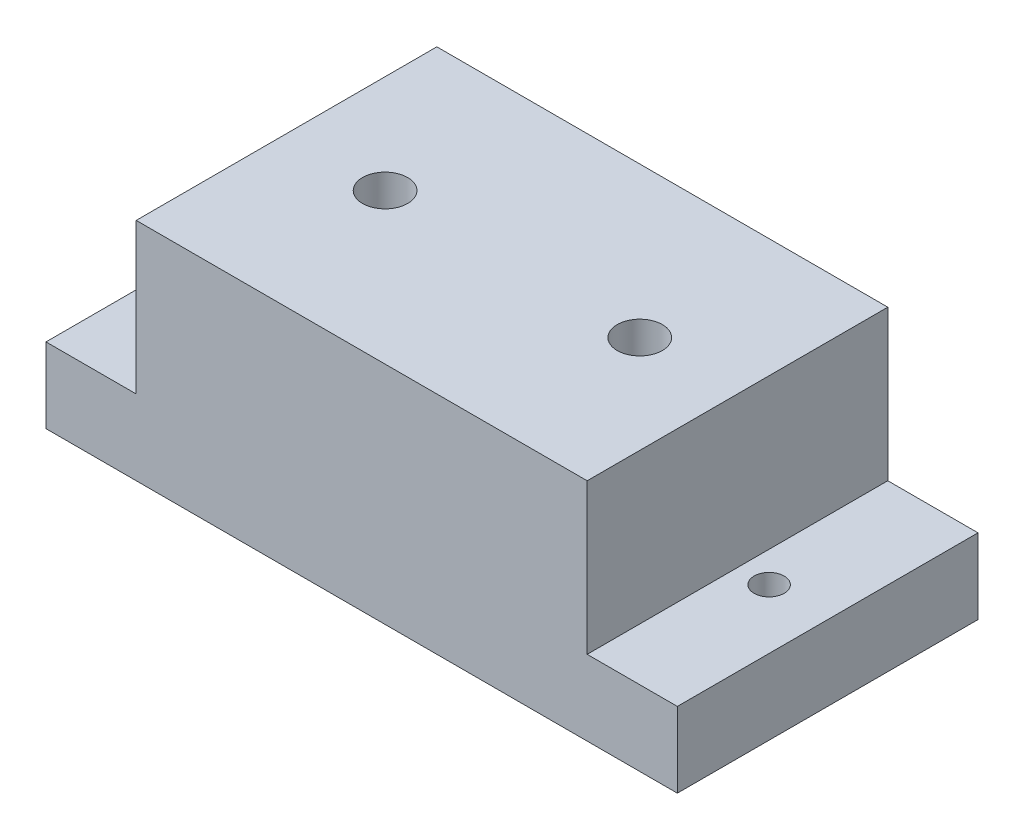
ISO-10303-21;
HEADER;
FILE_DESCRIPTION(('STEP AP214'),'2;1');
FILE_NAME('part.step','',(''),(''),'','','');
FILE_SCHEMA(('AUTOMOTIVE_DESIGN { 1 0 10303 214 1 1 1 1 }'));
ENDSEC;
DATA;
#1=APPLICATION_CONTEXT('core data for automotive mechanical design processes');
#2=APPLICATION_PROTOCOL_DEFINITION('international standard','automotive_design',2000,#1);
#3=PRODUCT_CONTEXT('',#1,'mechanical');
#4=PRODUCT('Part','Part','',(#3));
#5=PRODUCT_RELATED_PRODUCT_CATEGORY('part','',(#4));
#6=PRODUCT_DEFINITION_FORMATION('','',#4);
#7=PRODUCT_DEFINITION_CONTEXT('part definition',#1,'design');
#8=PRODUCT_DEFINITION('design','',#6,#7);
#9=PRODUCT_DEFINITION_SHAPE('','',#8);
#10=(LENGTH_UNIT() NAMED_UNIT(*) SI_UNIT(.MILLI.,.METRE.));
#11=(NAMED_UNIT(*) PLANE_ANGLE_UNIT() SI_UNIT($,.RADIAN.));
#12=(NAMED_UNIT(*) SI_UNIT($,.STERADIAN.) SOLID_ANGLE_UNIT());
#13=UNCERTAINTY_MEASURE_WITH_UNIT(LENGTH_MEASURE(1.E-05),#10,'distance_accuracy_value','');
#14=(GEOMETRIC_REPRESENTATION_CONTEXT(3) GLOBAL_UNCERTAINTY_ASSIGNED_CONTEXT((#13)) GLOBAL_UNIT_ASSIGNED_CONTEXT((#10,
#11,#12)) REPRESENTATION_CONTEXT('',''));
#15=CARTESIAN_POINT('',(0.,0.,0.));
#16=DIRECTION('',(0.,0.,1.));
#17=DIRECTION('',(1.,0.,0.));
#18=AXIS2_PLACEMENT_3D('',#15,#16,#17);
#19=CARTESIAN_POINT('',(-42.,0.,40.));
#20=DIRECTION('',(0.,1.,0.));
#21=DIRECTION('',(-1.,0.,0.));
#22=AXIS2_PLACEMENT_3D('',#19,#20,#21);
#23=PLANE('',#22);
#24=DIRECTION('',(-0.875367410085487,0.,-0.483458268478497));
#25=VECTOR('',#24,1.);
#26=CARTESIAN_POINT('',(-11.860847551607,0.,16.9012731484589));
#27=LINE('',#26,#25);
#28=CARTESIAN_POINT('',(-11.860847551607,0.,16.9012731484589));
#29=VERTEX_POINT('',#28);
#30=CARTESIAN_POINT('',(-17.1139999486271,0.,14.));
#31=VERTEX_POINT('',#30);
#32=EDGE_CURVE('E369',#29,#31,#27,.T.);
#33=ORIENTED_EDGE('',*,*,#32,.T.);
#34=DIRECTION('',(-0.856370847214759,0.,0.516361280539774));
#35=VECTOR('',#34,1.);
#36=CARTESIAN_POINT('',(-17.1139999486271,0.,14.));
#37=LINE('',#36,#35);
#38=CARTESIAN_POINT('',(-22.2531523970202,0.,17.0987268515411));
#39=VERTEX_POINT('',#38);
#40=EDGE_CURVE('E530',#31,#39,#37,.T.);
#41=ORIENTED_EDGE('',*,*,#40,.T.);
#42=DIRECTION('',(0.0189965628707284,0.,0.999819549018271));
#43=VECTOR('',#42,1.);
#44=CARTESIAN_POINT('',(-22.2531523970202,0.,17.0987268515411));
#45=LINE('',#44,#43);
#46=CARTESIAN_POINT('',(-22.1391524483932,0.,23.0987268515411));
#47=VERTEX_POINT('',#46);
#48=EDGE_CURVE('E527',#39,#47,#45,.T.);
#49=ORIENTED_EDGE('',*,*,#48,.T.);
#50=DIRECTION('',(0.875367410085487,0.,0.483458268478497));
#51=VECTOR('',#50,1.);
#52=CARTESIAN_POINT('',(-22.1391524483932,0.,23.0987268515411));
#53=LINE('',#52,#51);
#54=CARTESIAN_POINT('',(-16.8860000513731,0.,26.));
#55=VERTEX_POINT('',#54);
#56=EDGE_CURVE('E524',#47,#55,#53,.T.);
#57=ORIENTED_EDGE('',*,*,#56,.T.);
#58=DIRECTION('',(0.856370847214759,0.,-0.516361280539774));
#59=VECTOR('',#58,1.);
#60=CARTESIAN_POINT('',(-16.8860000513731,0.,26.));
#61=LINE('',#60,#59);
#62=CARTESIAN_POINT('',(-11.74684760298,0.,22.9012731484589));
#63=VERTEX_POINT('',#62);
#64=EDGE_CURVE('E516',#55,#63,#61,.T.);
#65=ORIENTED_EDGE('',*,*,#64,.T.);
#66=DIRECTION('',(-0.0189965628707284,0.,-0.999819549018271));
#67=VECTOR('',#66,1.);
#68=CARTESIAN_POINT('',(-11.74684760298,0.,22.9012731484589));
#69=LINE('',#68,#67);
#70=EDGE_CURVE('E514',#63,#29,#69,.T.);
#71=ORIENTED_EDGE('',*,*,#70,.T.);
#72=EDGE_LOOP('',(#33,#41,#49,#57,#65,#71));
#73=FACE_BOUND('',#72,.T.);
#74=DIRECTION('',(1.,0.,0.));
#75=VECTOR('',#74,1.);
#76=CARTESIAN_POINT('',(-42.,0.,0.));
#77=LINE('',#76,#75);
#78=CARTESIAN_POINT('',(-42.,0.,0.));
#79=VERTEX_POINT('',#78);
#80=CARTESIAN_POINT('',(42.,0.,0.));
#81=VERTEX_POINT('',#80);
#82=EDGE_CURVE('E590',#79,#81,#77,.T.);
#83=ORIENTED_EDGE('',*,*,#82,.T.);
#84=DIRECTION('',(0.,0.,-1.));
#85=VECTOR('',#84,1.);
#86=CARTESIAN_POINT('',(42.,0.,40.));
#87=LINE('',#86,#85);
#88=CARTESIAN_POINT('',(42.,0.,40.));
#89=VERTEX_POINT('',#88);
#90=EDGE_CURVE('E609',#89,#81,#87,.T.);
#91=ORIENTED_EDGE('',*,*,#90,.F.);
#92=DIRECTION('',(1.,0.,0.));
#93=VECTOR('',#92,1.);
#94=CARTESIAN_POINT('',(-42.,0.,40.));
#95=LINE('',#94,#93);
#96=CARTESIAN_POINT('',(-42.,0.,40.));
#97=VERTEX_POINT('',#96);
#98=EDGE_CURVE('E607',#97,#89,#95,.T.);
#99=ORIENTED_EDGE('',*,*,#98,.F.);
#100=DIRECTION('',(0.,0.,-1.));
#101=VECTOR('',#100,1.);
#102=CARTESIAN_POINT('',(-42.,0.,40.));
#103=LINE('',#102,#101);
#104=EDGE_CURVE('E612',#97,#79,#103,.T.);
#105=ORIENTED_EDGE('',*,*,#104,.T.);
#106=EDGE_LOOP('',(#83,#91,#99,#105));
#107=FACE_BOUND('',#106,.T.);
#108=DIRECTION('',(-0.863695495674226,0.,-0.504013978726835));
#109=VECTOR('',#108,1.);
#110=CARTESIAN_POINT('',(22.2100760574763,0.,17.0241164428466));
#111=LINE('',#110,#109);
#112=CARTESIAN_POINT('',(22.2100760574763,0.,17.0241164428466));
#113=VERTEX_POINT('',#112);
#114=CARTESIAN_POINT('',(17.0278472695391,0.,14.));
#115=VERTEX_POINT('',#114);
#116=EDGE_CURVE('E377',#113,#115,#111,.T.);
#117=ORIENTED_EDGE('',*,*,#116,.T.);
#118=DIRECTION('',(-0.868336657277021,0.,0.495975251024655));
#119=VECTOR('',#118,1.);
#120=CARTESIAN_POINT('',(17.0278472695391,0.,14.));
#121=LINE('',#120,#119);
#122=CARTESIAN_POINT('',(11.8177712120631,0.,16.9758835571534));
#123=VERTEX_POINT('',#122);
#124=EDGE_CURVE('E535',#115,#123,#121,.T.);
#125=ORIENTED_EDGE('',*,*,#124,.T.);
#126=DIRECTION('',(-0.00464116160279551,0.,0.999989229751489));
#127=VECTOR('',#126,1.);
#128=CARTESIAN_POINT('',(11.8177712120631,0.,16.9758835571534));
#129=LINE('',#128,#127);
#130=CARTESIAN_POINT('',(11.7899239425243,0.,22.9758835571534));
#131=VERTEX_POINT('',#130);
#132=EDGE_CURVE('E538',#123,#131,#129,.T.);
#133=ORIENTED_EDGE('',*,*,#132,.T.);
#134=DIRECTION('',(0.863695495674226,0.,0.504013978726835));
#135=VECTOR('',#134,1.);
#136=CARTESIAN_POINT('',(11.7899239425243,0.,22.9758835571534));
#137=LINE('',#136,#135);
#138=CARTESIAN_POINT('',(16.9721527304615,0.,26.));
#139=VERTEX_POINT('',#138);
#140=EDGE_CURVE('E541',#131,#139,#137,.T.);
#141=ORIENTED_EDGE('',*,*,#140,.T.);
#142=DIRECTION('',(0.868336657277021,0.,-0.495975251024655));
#143=VECTOR('',#142,1.);
#144=CARTESIAN_POINT('',(16.9721527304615,0.,26.));
#145=LINE('',#144,#143);
#146=CARTESIAN_POINT('',(22.1822287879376,0.,23.0241164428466));
#147=VERTEX_POINT('',#146);
#148=EDGE_CURVE('E544',#139,#147,#145,.T.);
#149=ORIENTED_EDGE('',*,*,#148,.T.);
#150=DIRECTION('',(0.00464116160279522,0.,-0.999989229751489));
#151=VECTOR('',#150,1.);
#152=CARTESIAN_POINT('',(22.1822287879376,0.,23.0241164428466));
#153=LINE('',#152,#151);
#154=EDGE_CURVE('E547',#147,#113,#153,.T.);
#155=ORIENTED_EDGE('',*,*,#154,.T.);
#156=EDGE_LOOP('',(#117,#125,#133,#141,#149,#155));
#157=FACE_BOUND('',#156,.T.);
#158=CARTESIAN_POINT('',(34.079526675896,0.,19.8692984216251));
#159=DIRECTION('',(0.,-1.,0.));
#160=DIRECTION('',(1.,0.,0.));
#161=AXIS2_PLACEMENT_3D('',#158,#159,#160);
#162=CIRCLE('',#161,2.);
#163=CARTESIAN_POINT('',(36.079526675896,0.,19.8692984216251));
#164=VERTEX_POINT('',#163);
#165=EDGE_CURVE('E631',#164,#164,#162,.T.);
#166=ORIENTED_EDGE('',*,*,#165,.F.);
#167=EDGE_LOOP('',(#166));
#168=FACE_BOUND('',#167,.T.);
#169=CARTESIAN_POINT('',(-33.6424279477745,0.,20.));
#170=DIRECTION('',(0.,1.,0.));
#171=DIRECTION('',(1.,0.,0.));
#172=AXIS2_PLACEMENT_3D('',#169,#170,#171);
#173=CIRCLE('',#172,2.);
#174=CARTESIAN_POINT('',(-31.6424279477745,0.,20.));
#175=VERTEX_POINT('',#174);
#176=EDGE_CURVE('E642',#175,#175,#173,.T.);
#177=ORIENTED_EDGE('',*,*,#176,.T.);
#178=EDGE_LOOP('',(#177));
#179=FACE_BOUND('',#178,.T.);
#180=ADVANCED_FACE('F352',(#73,#107,#157,#168,#179),#23,.F.);
#181=CARTESIAN_POINT('',(-42.,9.99999999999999,40.));
#182=DIRECTION('',(0.,-1.,0.));
#183=DIRECTION('',(1.,0.,0.));
#184=AXIS2_PLACEMENT_3D('',#181,#182,#183);
#185=PLANE('',#184);
#186=DIRECTION('',(-1.,0.,0.));
#187=VECTOR('',#186,1.);
#188=CARTESIAN_POINT('',(-42.,9.99999999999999,0.));
#189=LINE('',#188,#187);
#190=CARTESIAN_POINT('',(-30.,9.99999999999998,0.));
#191=VERTEX_POINT('',#190);
#192=CARTESIAN_POINT('',(-42.,9.99999999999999,0.));
#193=VERTEX_POINT('',#192);
#194=EDGE_CURVE('E586',#191,#193,#189,.T.);
#195=ORIENTED_EDGE('',*,*,#194,.T.);
#196=DIRECTION('',(0.,0.,-1.));
#197=VECTOR('',#196,1.);
#198=CARTESIAN_POINT('',(-42.,9.99999999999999,40.));
#199=LINE('',#198,#197);
#200=CARTESIAN_POINT('',(-42.,9.99999999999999,40.));
#201=VERTEX_POINT('',#200);
#202=EDGE_CURVE('E615',#201,#193,#199,.T.);
#203=ORIENTED_EDGE('',*,*,#202,.F.);
#204=DIRECTION('',(-1.,0.,0.));
#205=VECTOR('',#204,1.);
#206=CARTESIAN_POINT('',(-42.,9.99999999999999,40.));
#207=LINE('',#206,#205);
#208=CARTESIAN_POINT('',(-30.,9.99999999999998,40.));
#209=VERTEX_POINT('',#208);
#210=EDGE_CURVE('E603',#209,#201,#207,.T.);
#211=ORIENTED_EDGE('',*,*,#210,.F.);
#212=DIRECTION('',(0.,0.,-1.));
#213=VECTOR('',#212,1.);
#214=CARTESIAN_POINT('',(-30.,9.99999999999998,40.));
#215=LINE('',#214,#213);
#216=EDGE_CURVE('E618',#209,#191,#215,.T.);
#217=ORIENTED_EDGE('',*,*,#216,.T.);
#218=EDGE_LOOP('',(#195,#203,#211,#217));
#219=FACE_BOUND('',#218,.T.);
#220=CARTESIAN_POINT('',(-33.6424279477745,9.99999999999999,20.));
#221=DIRECTION('',(0.,-1.,0.));
#222=DIRECTION('',(1.,0.,0.));
#223=AXIS2_PLACEMENT_3D('',#220,#221,#222);
#224=CIRCLE('',#223,2.);
#225=CARTESIAN_POINT('',(-31.6424279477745,9.99999999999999,20.));
#226=VERTEX_POINT('',#225);
#227=EDGE_CURVE('E356',#226,#226,#224,.F.);
#228=ORIENTED_EDGE('',*,*,#227,.F.);
#229=EDGE_LOOP('',(#228));
#230=FACE_BOUND('',#229,.T.);
#231=ADVANCED_FACE('F691',(#219,#230),#185,.F.);
#232=CARTESIAN_POINT('',(42.,0.,40.));
#233=DIRECTION('',(-1.,0.,0.));
#234=DIRECTION('',(0.,0.,1.));
#235=AXIS2_PLACEMENT_3D('',#232,#233,#234);
#236=PLANE('',#235);
#237=DIRECTION('',(0.,1.,0.));
#238=VECTOR('',#237,1.);
#239=CARTESIAN_POINT('',(42.,0.,0.));
#240=LINE('',#239,#238);
#241=CARTESIAN_POINT('',(42.,10.,0.));
#242=VERTEX_POINT('',#241);
#243=EDGE_CURVE('E575',#81,#242,#240,.T.);
#244=ORIENTED_EDGE('',*,*,#243,.T.);
#245=DIRECTION('',(0.,0.,-1.));
#246=VECTOR('',#245,1.);
#247=CARTESIAN_POINT('',(42.,10.,40.));
#248=LINE('',#247,#246);
#249=CARTESIAN_POINT('',(42.,10.,40.));
#250=VERTEX_POINT('',#249);
#251=EDGE_CURVE('E11',#250,#242,#248,.T.);
#252=ORIENTED_EDGE('',*,*,#251,.F.);
#253=DIRECTION('',(0.,1.,0.));
#254=VECTOR('',#253,1.);
#255=CARTESIAN_POINT('',(42.,0.,40.));
#256=LINE('',#255,#254);
#257=EDGE_CURVE('E592',#89,#250,#256,.T.);
#258=ORIENTED_EDGE('',*,*,#257,.F.);
#259=ORIENTED_EDGE('',*,*,#90,.T.);
#260=EDGE_LOOP('',(#244,#252,#258,#259));
#261=FACE_BOUND('',#260,.T.);
#262=ADVANCED_FACE('F354',(#261),#236,.F.);
#263=CARTESIAN_POINT('',(42.,10.,40.));
#264=DIRECTION('',(0.,-1.,0.));
#265=DIRECTION('',(1.,0.,0.));
#266=AXIS2_PLACEMENT_3D('',#263,#264,#265);
#267=PLANE('',#266);
#268=CARTESIAN_POINT('',(34.079526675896,10.,19.8692984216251));
#269=DIRECTION('',(0.,-1.,0.));
#270=DIRECTION('',(1.,0.,0.));
#271=AXIS2_PLACEMENT_3D('',#268,#269,#270);
#272=CIRCLE('',#271,2.);
#273=CARTESIAN_POINT('',(36.079526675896,10.,19.8692984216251));
#274=VERTEX_POINT('',#273);
#275=EDGE_CURVE('E628',#274,#274,#272,.T.);
#276=ORIENTED_EDGE('',*,*,#275,.T.);
#277=EDGE_LOOP('',(#276));
#278=FACE_BOUND('',#277,.T.);
#279=DIRECTION('',(-1.,0.,0.));
#280=VECTOR('',#279,1.);
#281=CARTESIAN_POINT('',(42.,10.,0.));
#282=LINE('',#281,#280);
#283=CARTESIAN_POINT('',(30.,10.,0.));
#284=VERTEX_POINT('',#283);
#285=EDGE_CURVE('E578',#242,#284,#282,.T.);
#286=ORIENTED_EDGE('',*,*,#285,.T.);
#287=DIRECTION('',(0.,0.,-1.));
#288=VECTOR('',#287,1.);
#289=CARTESIAN_POINT('',(30.,10.,40.));
#290=LINE('',#289,#288);
#291=CARTESIAN_POINT('',(30.,10.,40.));
#292=VERTEX_POINT('',#291);
#293=EDGE_CURVE('E361',#292,#284,#290,.T.);
#294=ORIENTED_EDGE('',*,*,#293,.F.);
#295=DIRECTION('',(-1.,0.,0.));
#296=VECTOR('',#295,1.);
#297=CARTESIAN_POINT('',(42.,10.,40.));
#298=LINE('',#297,#296);
#299=EDGE_CURVE('E595',#250,#292,#298,.T.);
#300=ORIENTED_EDGE('',*,*,#299,.F.);
#301=ORIENTED_EDGE('',*,*,#251,.T.);
#302=EDGE_LOOP('',(#286,#294,#300,#301));
#303=FACE_BOUND('',#302,.T.);
#304=ADVANCED_FACE('F717',(#278,#303),#267,.F.);
#305=CARTESIAN_POINT('',(30.,10.,40.));
#306=DIRECTION('',(-1.,0.,0.));
#307=DIRECTION('',(0.,0.,1.));
#308=AXIS2_PLACEMENT_3D('',#305,#306,#307);
#309=PLANE('',#308);
#310=DIRECTION('',(0.,1.,0.));
#311=VECTOR('',#310,1.);
#312=CARTESIAN_POINT('',(30.,10.,0.));
#313=LINE('',#312,#311);
#314=CARTESIAN_POINT('',(30.,30.,0.));
#315=VERTEX_POINT('',#314);
#316=EDGE_CURVE('E580',#284,#315,#313,.T.);
#317=ORIENTED_EDGE('',*,*,#316,.T.);
#318=DIRECTION('',(0.,0.,-1.));
#319=VECTOR('',#318,1.);
#320=CARTESIAN_POINT('',(30.,30.,40.));
#321=LINE('',#320,#319);
#322=CARTESIAN_POINT('',(30.,30.,40.));
#323=VERTEX_POINT('',#322);
#324=EDGE_CURVE('E624',#323,#315,#321,.T.);
#325=ORIENTED_EDGE('',*,*,#324,.F.);
#326=DIRECTION('',(0.,1.,0.));
#327=VECTOR('',#326,1.);
#328=CARTESIAN_POINT('',(30.,10.,40.));
#329=LINE('',#328,#327);
#330=EDGE_CURVE('E597',#292,#323,#329,.T.);
#331=ORIENTED_EDGE('',*,*,#330,.F.);
#332=ORIENTED_EDGE('',*,*,#293,.T.);
#333=EDGE_LOOP('',(#317,#325,#331,#332));
#334=FACE_BOUND('',#333,.T.);
#335=ADVANCED_FACE('F714',(#334),#309,.F.);
#336=CARTESIAN_POINT('',(30.,30.,40.));
#337=DIRECTION('',(0.,-1.,0.));
#338=DIRECTION('',(1.,0.,0.));
#339=AXIS2_PLACEMENT_3D('',#336,#337,#338);
#340=PLANE('',#339);
#341=CARTESIAN_POINT('',(-16.8860000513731,30.,20.));
#342=DIRECTION('',(0.,-1.,0.));
#343=DIRECTION('',(1.,0.,0.));
#344=AXIS2_PLACEMENT_3D('',#341,#342,#343);
#345=CIRCLE('',#344,3.);
#346=CARTESIAN_POINT('',(-13.8860000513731,30.,20.));
#347=VERTEX_POINT('',#346);
#348=EDGE_CURVE('E630',#347,#347,#345,.T.);
#349=ORIENTED_EDGE('',*,*,#348,.T.);
#350=EDGE_LOOP('',(#349));
#351=FACE_BOUND('',#350,.T.);
#352=CARTESIAN_POINT('',(17.0000000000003,30.,20.));
#353=DIRECTION('',(0.,-1.,0.));
#354=DIRECTION('',(1.,0.,0.));
#355=AXIS2_PLACEMENT_3D('',#352,#353,#354);
#356=CIRCLE('',#355,3.);
#357=CARTESIAN_POINT('',(20.0000000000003,30.,20.));
#358=VERTEX_POINT('',#357);
#359=EDGE_CURVE('E650',#358,#358,#356,.T.);
#360=ORIENTED_EDGE('',*,*,#359,.T.);
#361=EDGE_LOOP('',(#360));
#362=FACE_BOUND('',#361,.T.);
#363=DIRECTION('',(-1.,0.,0.));
#364=VECTOR('',#363,1.);
#365=CARTESIAN_POINT('',(30.,30.,0.));
#366=LINE('',#365,#364);
#367=CARTESIAN_POINT('',(-30.,30.,0.));
#368=VERTEX_POINT('',#367);
#369=EDGE_CURVE('E582',#315,#368,#366,.T.);
#370=ORIENTED_EDGE('',*,*,#369,.T.);
#371=DIRECTION('',(0.,0.,-1.));
#372=VECTOR('',#371,1.);
#373=CARTESIAN_POINT('',(-30.,30.,40.));
#374=LINE('',#373,#372);
#375=CARTESIAN_POINT('',(-30.,30.,40.));
#376=VERTEX_POINT('',#375);
#377=EDGE_CURVE('E621',#376,#368,#374,.T.);
#378=ORIENTED_EDGE('',*,*,#377,.F.);
#379=DIRECTION('',(-1.,0.,0.));
#380=VECTOR('',#379,1.);
#381=CARTESIAN_POINT('',(30.,30.,40.));
#382=LINE('',#381,#380);
#383=EDGE_CURVE('E599',#323,#376,#382,.T.);
#384=ORIENTED_EDGE('',*,*,#383,.F.);
#385=ORIENTED_EDGE('',*,*,#324,.T.);
#386=EDGE_LOOP('',(#370,#378,#384,#385));
#387=FACE_BOUND('',#386,.T.);
#388=ADVANCED_FACE('F710',(#351,#362,#387),#340,.F.);
#389=CARTESIAN_POINT('',(-30.,9.99999999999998,40.));
#390=DIRECTION('',(1.,0.,0.));
#391=DIRECTION('',(0.,1.,0.));
#392=AXIS2_PLACEMENT_3D('',#389,#390,#391);
#393=PLANE('',#392);
#394=DIRECTION('',(0.,-1.,0.));
#395=VECTOR('',#394,1.);
#396=CARTESIAN_POINT('',(-30.,9.99999999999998,0.));
#397=LINE('',#396,#395);
#398=EDGE_CURVE('E584',#368,#191,#397,.T.);
#399=ORIENTED_EDGE('',*,*,#398,.T.);
#400=ORIENTED_EDGE('',*,*,#216,.F.);
#401=DIRECTION('',(0.,-1.,0.));
#402=VECTOR('',#401,1.);
#403=CARTESIAN_POINT('',(-30.,9.99999999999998,40.));
#404=LINE('',#403,#402);
#405=EDGE_CURVE('E601',#376,#209,#404,.T.);
#406=ORIENTED_EDGE('',*,*,#405,.F.);
#407=ORIENTED_EDGE('',*,*,#377,.T.);
#408=EDGE_LOOP('',(#399,#400,#406,#407));
#409=FACE_BOUND('',#408,.T.);
#410=ADVANCED_FACE('F705',(#409),#393,.F.);
#411=CARTESIAN_POINT('',(-42.,0.,40.));
#412=DIRECTION('',(1.,0.,0.));
#413=DIRECTION('',(0.,1.,0.));
#414=AXIS2_PLACEMENT_3D('',#411,#412,#413);
#415=PLANE('',#414);
#416=DIRECTION('',(0.,-1.,0.));
#417=VECTOR('',#416,1.);
#418=CARTESIAN_POINT('',(-42.,0.,0.));
#419=LINE('',#418,#417);
#420=EDGE_CURVE('E588',#193,#79,#419,.T.);
#421=ORIENTED_EDGE('',*,*,#420,.T.);
#422=ORIENTED_EDGE('',*,*,#104,.F.);
#423=DIRECTION('',(0.,-1.,0.));
#424=VECTOR('',#423,1.);
#425=CARTESIAN_POINT('',(-42.,0.,40.));
#426=LINE('',#425,#424);
#427=EDGE_CURVE('E605',#201,#97,#426,.T.);
#428=ORIENTED_EDGE('',*,*,#427,.F.);
#429=ORIENTED_EDGE('',*,*,#202,.T.);
#430=EDGE_LOOP('',(#421,#422,#428,#429));
#431=FACE_BOUND('',#430,.T.);
#432=ADVANCED_FACE('F703',(#431),#415,.F.);
#433=CARTESIAN_POINT('',(42.,10.,40.));
#434=DIRECTION('',(0.,0.,1.));
#435=DIRECTION('',(1.,0.,0.));
#436=AXIS2_PLACEMENT_3D('',#433,#434,#435);
#437=PLANE('',#436);
#438=ORIENTED_EDGE('',*,*,#257,.T.);
#439=ORIENTED_EDGE('',*,*,#299,.T.);
#440=ORIENTED_EDGE('',*,*,#330,.T.);
#441=ORIENTED_EDGE('',*,*,#383,.T.);
#442=ORIENTED_EDGE('',*,*,#405,.T.);
#443=ORIENTED_EDGE('',*,*,#210,.T.);
#444=ORIENTED_EDGE('',*,*,#427,.T.);
#445=ORIENTED_EDGE('',*,*,#98,.T.);
#446=EDGE_LOOP('',(#438,#439,#440,#441,#442,#443,#444,#445));
#447=FACE_BOUND('',#446,.T.);
#448=ADVANCED_FACE('F701',(#447),#437,.T.);
#449=CARTESIAN_POINT('',(42.,10.,0.));
#450=DIRECTION('',(0.,0.,1.));
#451=DIRECTION('',(1.,0.,0.));
#452=AXIS2_PLACEMENT_3D('',#449,#450,#451);
#453=PLANE('',#452);
#454=ORIENTED_EDGE('',*,*,#243,.F.);
#455=ORIENTED_EDGE('',*,*,#82,.F.);
#456=ORIENTED_EDGE('',*,*,#420,.F.);
#457=ORIENTED_EDGE('',*,*,#194,.F.);
#458=ORIENTED_EDGE('',*,*,#398,.F.);
#459=ORIENTED_EDGE('',*,*,#369,.F.);
#460=ORIENTED_EDGE('',*,*,#316,.F.);
#461=ORIENTED_EDGE('',*,*,#285,.F.);
#462=EDGE_LOOP('',(#454,#455,#456,#457,#458,#459,#460,#461));
#463=FACE_BOUND('',#462,.T.);
#464=ADVANCED_FACE('F734',(#463),#453,.F.);
#465=CARTESIAN_POINT('',(22.2100760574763,4.2,17.0241164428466));
#466=DIRECTION('',(-0.504013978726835,0.,0.863695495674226));
#467=DIRECTION('',(0.863695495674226,0.,0.504013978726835));
#468=AXIS2_PLACEMENT_3D('',#465,#466,#467);
#469=PLANE('',#468);
#470=ORIENTED_EDGE('',*,*,#116,.F.);
#471=DIRECTION('',(0.,-1.,0.));
#472=VECTOR('',#471,1.);
#473=CARTESIAN_POINT('',(22.2100760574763,4.2,17.0241164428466));
#474=LINE('',#473,#472);
#475=CARTESIAN_POINT('',(22.2100760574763,4.2,17.0241164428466));
#476=VERTEX_POINT('',#475);
#477=EDGE_CURVE('E563',#476,#113,#474,.T.);
#478=ORIENTED_EDGE('',*,*,#477,.F.);
#479=DIRECTION('',(-0.863695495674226,0.,-0.504013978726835));
#480=VECTOR('',#479,1.);
#481=CARTESIAN_POINT('',(22.2100760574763,4.2,17.0241164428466));
#482=LINE('',#481,#480);
#483=CARTESIAN_POINT('',(17.0278472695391,4.2,14.));
#484=VERTEX_POINT('',#483);
#485=EDGE_CURVE('E550',#476,#484,#482,.T.);
#486=ORIENTED_EDGE('',*,*,#485,.T.);
#487=DIRECTION('',(0.,-1.,0.));
#488=VECTOR('',#487,1.);
#489=CARTESIAN_POINT('',(17.0278472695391,4.2,14.));
#490=LINE('',#489,#488);
#491=EDGE_CURVE('E573',#484,#115,#490,.T.);
#492=ORIENTED_EDGE('',*,*,#491,.T.);
#493=EDGE_LOOP('',(#470,#478,#486,#492));
#494=FACE_BOUND('',#493,.T.);
#495=ADVANCED_FACE('F790',(#494),#469,.T.);
#496=CARTESIAN_POINT('',(17.0278472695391,4.2,14.));
#497=DIRECTION('',(0.495975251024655,0.,0.868336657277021));
#498=DIRECTION('',(0.868336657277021,0.,-0.495975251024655));
#499=AXIS2_PLACEMENT_3D('',#496,#497,#498);
#500=PLANE('',#499);
#501=ORIENTED_EDGE('',*,*,#124,.F.);
#502=ORIENTED_EDGE('',*,*,#491,.F.);
#503=DIRECTION('',(-0.868336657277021,0.,0.495975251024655));
#504=VECTOR('',#503,1.);
#505=CARTESIAN_POINT('',(17.0278472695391,4.2,14.));
#506=LINE('',#505,#504);
#507=CARTESIAN_POINT('',(11.8177712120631,4.2,16.9758835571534));
#508=VERTEX_POINT('',#507);
#509=EDGE_CURVE('E553',#484,#508,#506,.T.);
#510=ORIENTED_EDGE('',*,*,#509,.T.);
#511=DIRECTION('',(0.,-1.,0.));
#512=VECTOR('',#511,1.);
#513=CARTESIAN_POINT('',(11.8177712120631,4.2,16.9758835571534));
#514=LINE('',#513,#512);
#515=EDGE_CURVE('E571',#508,#123,#514,.T.);
#516=ORIENTED_EDGE('',*,*,#515,.T.);
#517=EDGE_LOOP('',(#501,#502,#510,#516));
#518=FACE_BOUND('',#517,.T.);
#519=ADVANCED_FACE('F792',(#518),#500,.T.);
#520=CARTESIAN_POINT('',(11.8177712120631,4.2,16.9758835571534));
#521=DIRECTION('',(0.999989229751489,0.,0.00464116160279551));
#522=DIRECTION('',(0.00464116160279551,0.,-0.999989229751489));
#523=AXIS2_PLACEMENT_3D('',#520,#521,#522);
#524=PLANE('',#523);
#525=ORIENTED_EDGE('',*,*,#132,.F.);
#526=ORIENTED_EDGE('',*,*,#515,.F.);
#527=DIRECTION('',(-0.00464116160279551,0.,0.999989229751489));
#528=VECTOR('',#527,1.);
#529=CARTESIAN_POINT('',(11.8177712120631,4.2,16.9758835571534));
#530=LINE('',#529,#528);
#531=CARTESIAN_POINT('',(11.7899239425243,4.2,22.9758835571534));
#532=VERTEX_POINT('',#531);
#533=EDGE_CURVE('E555',#508,#532,#530,.T.);
#534=ORIENTED_EDGE('',*,*,#533,.T.);
#535=DIRECTION('',(0.,-1.,0.));
#536=VECTOR('',#535,1.);
#537=CARTESIAN_POINT('',(11.7899239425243,4.2,22.9758835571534));
#538=LINE('',#537,#536);
#539=EDGE_CURVE('E569',#532,#131,#538,.T.);
#540=ORIENTED_EDGE('',*,*,#539,.T.);
#541=EDGE_LOOP('',(#525,#526,#534,#540));
#542=FACE_BOUND('',#541,.T.);
#543=ADVANCED_FACE('F809',(#542),#524,.T.);
#544=CARTESIAN_POINT('',(11.7899239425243,4.2,22.9758835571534));
#545=DIRECTION('',(0.504013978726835,0.,-0.863695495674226));
#546=DIRECTION('',(-0.863695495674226,0.,-0.504013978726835));
#547=AXIS2_PLACEMENT_3D('',#544,#545,#546);
#548=PLANE('',#547);
#549=ORIENTED_EDGE('',*,*,#140,.F.);
#550=ORIENTED_EDGE('',*,*,#539,.F.);
#551=DIRECTION('',(0.863695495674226,0.,0.504013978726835));
#552=VECTOR('',#551,1.);
#553=CARTESIAN_POINT('',(11.7899239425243,4.2,22.9758835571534));
#554=LINE('',#553,#552);
#555=CARTESIAN_POINT('',(16.9721527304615,4.2,26.));
#556=VERTEX_POINT('',#555);
#557=EDGE_CURVE('E557',#532,#556,#554,.T.);
#558=ORIENTED_EDGE('',*,*,#557,.T.);
#559=DIRECTION('',(0.,-1.,0.));
#560=VECTOR('',#559,1.);
#561=CARTESIAN_POINT('',(16.9721527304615,4.2,26.));
#562=LINE('',#561,#560);
#563=EDGE_CURVE('E567',#556,#139,#562,.T.);
#564=ORIENTED_EDGE('',*,*,#563,.T.);
#565=EDGE_LOOP('',(#549,#550,#558,#564));
#566=FACE_BOUND('',#565,.T.);
#567=ADVANCED_FACE('F807',(#566),#548,.T.);
#568=CARTESIAN_POINT('',(16.9721527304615,4.2,26.));
#569=DIRECTION('',(-0.495975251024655,0.,-0.868336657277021));
#570=DIRECTION('',(-0.868336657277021,0.,0.495975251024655));
#571=AXIS2_PLACEMENT_3D('',#568,#569,#570);
#572=PLANE('',#571);
#573=ORIENTED_EDGE('',*,*,#148,.F.);
#574=ORIENTED_EDGE('',*,*,#563,.F.);
#575=DIRECTION('',(0.868336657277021,0.,-0.495975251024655));
#576=VECTOR('',#575,1.);
#577=CARTESIAN_POINT('',(16.9721527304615,4.2,26.));
#578=LINE('',#577,#576);
#579=CARTESIAN_POINT('',(22.1822287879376,4.2,23.0241164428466));
#580=VERTEX_POINT('',#579);
#581=EDGE_CURVE('E559',#556,#580,#578,.T.);
#582=ORIENTED_EDGE('',*,*,#581,.T.);
#583=DIRECTION('',(0.,-1.,0.));
#584=VECTOR('',#583,1.);
#585=CARTESIAN_POINT('',(22.1822287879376,4.2,23.0241164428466));
#586=LINE('',#585,#584);
#587=EDGE_CURVE('E565',#580,#147,#586,.T.);
#588=ORIENTED_EDGE('',*,*,#587,.T.);
#589=EDGE_LOOP('',(#573,#574,#582,#588));
#590=FACE_BOUND('',#589,.T.);
#591=ADVANCED_FACE('F801',(#590),#572,.T.);
#592=CARTESIAN_POINT('',(22.1822287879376,4.2,23.0241164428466));
#593=DIRECTION('',(-0.999989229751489,0.,-0.00464116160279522));
#594=DIRECTION('',(-0.00464116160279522,0.,0.999989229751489));
#595=AXIS2_PLACEMENT_3D('',#592,#593,#594);
#596=PLANE('',#595);
#597=ORIENTED_EDGE('',*,*,#154,.F.);
#598=ORIENTED_EDGE('',*,*,#587,.F.);
#599=DIRECTION('',(0.00464116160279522,0.,-0.999989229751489));
#600=VECTOR('',#599,1.);
#601=CARTESIAN_POINT('',(22.1822287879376,4.2,23.0241164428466));
#602=LINE('',#601,#600);
#603=EDGE_CURVE('E561',#580,#476,#602,.T.);
#604=ORIENTED_EDGE('',*,*,#603,.T.);
#605=ORIENTED_EDGE('',*,*,#477,.T.);
#606=EDGE_LOOP('',(#597,#598,#604,#605));
#607=FACE_BOUND('',#606,.T.);
#608=ADVANCED_FACE('F783',(#607),#596,.T.);
#609=CARTESIAN_POINT('',(27.3923048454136,4.2,20.0482328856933));
#610=DIRECTION('',(0.,-1.,0.));
#611=DIRECTION('',(-1.,0.,0.));
#612=AXIS2_PLACEMENT_3D('',#609,#610,#611);
#613=PLANE('',#612);
#614=CARTESIAN_POINT('',(17.0000000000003,4.2,20.));
#615=DIRECTION('',(0.,-1.,0.));
#616=DIRECTION('',(1.,0.,0.));
#617=AXIS2_PLACEMENT_3D('',#614,#615,#616);
#618=CIRCLE('',#617,3.);
#619=CARTESIAN_POINT('',(20.0000000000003,4.2,20.));
#620=VERTEX_POINT('',#619);
#621=EDGE_CURVE('E647',#620,#620,#618,.T.);
#622=ORIENTED_EDGE('',*,*,#621,.F.);
#623=EDGE_LOOP('',(#622));
#624=FACE_BOUND('',#623,.T.);
#625=ORIENTED_EDGE('',*,*,#485,.F.);
#626=ORIENTED_EDGE('',*,*,#603,.F.);
#627=ORIENTED_EDGE('',*,*,#581,.F.);
#628=ORIENTED_EDGE('',*,*,#557,.F.);
#629=ORIENTED_EDGE('',*,*,#533,.F.);
#630=ORIENTED_EDGE('',*,*,#509,.F.);
#631=EDGE_LOOP('',(#625,#626,#627,#628,#629,#630));
#632=FACE_BOUND('',#631,.T.);
#633=ADVANCED_FACE('F688',(#624,#632),#613,.T.);
#634=CARTESIAN_POINT('',(-11.860847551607,4.2,16.9012731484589));
#635=DIRECTION('',(-0.483458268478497,0.,0.875367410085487));
#636=DIRECTION('',(0.875367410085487,0.,0.483458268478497));
#637=AXIS2_PLACEMENT_3D('',#634,#635,#636);
#638=PLANE('',#637);
#639=ORIENTED_EDGE('',*,*,#32,.F.);
#640=DIRECTION('',(0.,-1.,0.));
#641=VECTOR('',#640,1.);
#642=CARTESIAN_POINT('',(-11.860847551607,4.2,16.9012731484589));
#643=LINE('',#642,#641);
#644=CARTESIAN_POINT('',(-11.860847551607,4.2,16.9012731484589));
#645=VERTEX_POINT('',#644);
#646=EDGE_CURVE('E498',#645,#29,#643,.T.);
#647=ORIENTED_EDGE('',*,*,#646,.F.);
#648=DIRECTION('',(-0.875367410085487,0.,-0.483458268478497));
#649=VECTOR('',#648,1.);
#650=CARTESIAN_POINT('',(-11.860847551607,4.2,16.9012731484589));
#651=LINE('',#650,#649);
#652=CARTESIAN_POINT('',(-17.1139999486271,4.2,14.));
#653=VERTEX_POINT('',#652);
#654=EDGE_CURVE('E508',#645,#653,#651,.T.);
#655=ORIENTED_EDGE('',*,*,#654,.T.);
#656=DIRECTION('',(0.,-1.,0.));
#657=VECTOR('',#656,1.);
#658=CARTESIAN_POINT('',(-17.1139999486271,4.2,14.));
#659=LINE('',#658,#657);
#660=EDGE_CURVE('E653',#653,#31,#659,.T.);
#661=ORIENTED_EDGE('',*,*,#660,.T.);
#662=EDGE_LOOP('',(#639,#647,#655,#661));
#663=FACE_BOUND('',#662,.T.);
#664=ADVANCED_FACE('F507',(#663),#638,.T.);
#665=CARTESIAN_POINT('',(-17.1139999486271,4.2,14.));
#666=DIRECTION('',(0.516361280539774,0.,0.856370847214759));
#667=DIRECTION('',(0.856370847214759,0.,-0.516361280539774));
#668=AXIS2_PLACEMENT_3D('',#665,#666,#667);
#669=PLANE('',#668);
#670=ORIENTED_EDGE('',*,*,#40,.F.);
#671=ORIENTED_EDGE('',*,*,#660,.F.);
#672=DIRECTION('',(-0.856370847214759,0.,0.516361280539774));
#673=VECTOR('',#672,1.);
#674=CARTESIAN_POINT('',(-17.1139999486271,4.2,14.));
#675=LINE('',#674,#673);
#676=CARTESIAN_POINT('',(-22.2531523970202,4.2,17.0987268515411));
#677=VERTEX_POINT('',#676);
#678=EDGE_CURVE('E513',#653,#677,#675,.T.);
#679=ORIENTED_EDGE('',*,*,#678,.T.);
#680=DIRECTION('',(0.,-1.,0.));
#681=VECTOR('',#680,1.);
#682=CARTESIAN_POINT('',(-22.2531523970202,4.2,17.0987268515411));
#683=LINE('',#682,#681);
#684=EDGE_CURVE('E655',#677,#39,#683,.T.);
#685=ORIENTED_EDGE('',*,*,#684,.T.);
#686=EDGE_LOOP('',(#670,#671,#679,#685));
#687=FACE_BOUND('',#686,.T.);
#688=ADVANCED_FACE('F680',(#687),#669,.T.);
#689=CARTESIAN_POINT('',(-22.2531523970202,4.2,17.0987268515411));
#690=DIRECTION('',(0.999819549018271,0.,-0.0189965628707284));
#691=DIRECTION('',(-0.0189965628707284,0.,-0.999819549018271));
#692=AXIS2_PLACEMENT_3D('',#689,#690,#691);
#693=PLANE('',#692);
#694=ORIENTED_EDGE('',*,*,#48,.F.);
#695=ORIENTED_EDGE('',*,*,#684,.F.);
#696=DIRECTION('',(0.0189965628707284,0.,0.999819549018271));
#697=VECTOR('',#696,1.);
#698=CARTESIAN_POINT('',(-22.2531523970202,4.2,17.0987268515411));
#699=LINE('',#698,#697);
#700=CARTESIAN_POINT('',(-22.1391524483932,4.2,23.0987268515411));
#701=VERTEX_POINT('',#700);
#702=EDGE_CURVE('E518',#677,#701,#699,.T.);
#703=ORIENTED_EDGE('',*,*,#702,.T.);
#704=DIRECTION('',(0.,-1.,0.));
#705=VECTOR('',#704,1.);
#706=CARTESIAN_POINT('',(-22.1391524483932,4.2,23.0987268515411));
#707=LINE('',#706,#705);
#708=EDGE_CURVE('E657',#701,#47,#707,.T.);
#709=ORIENTED_EDGE('',*,*,#708,.T.);
#710=EDGE_LOOP('',(#694,#695,#703,#709));
#711=FACE_BOUND('',#710,.T.);
#712=ADVANCED_FACE('F668',(#711),#693,.T.);
#713=CARTESIAN_POINT('',(-22.1391524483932,4.2,23.0987268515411));
#714=DIRECTION('',(0.483458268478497,0.,-0.875367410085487));
#715=DIRECTION('',(-0.875367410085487,0.,-0.483458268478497));
#716=AXIS2_PLACEMENT_3D('',#713,#714,#715);
#717=PLANE('',#716);
#718=ORIENTED_EDGE('',*,*,#56,.F.);
#719=ORIENTED_EDGE('',*,*,#708,.F.);
#720=DIRECTION('',(0.875367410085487,0.,0.483458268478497));
#721=VECTOR('',#720,1.);
#722=CARTESIAN_POINT('',(-22.1391524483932,4.2,23.0987268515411));
#723=LINE('',#722,#721);
#724=CARTESIAN_POINT('',(-16.8860000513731,4.2,26.));
#725=VERTEX_POINT('',#724);
#726=EDGE_CURVE('E663',#701,#725,#723,.T.);
#727=ORIENTED_EDGE('',*,*,#726,.T.);
#728=DIRECTION('',(0.,-1.,0.));
#729=VECTOR('',#728,1.);
#730=CARTESIAN_POINT('',(-16.8860000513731,4.2,26.));
#731=LINE('',#730,#729);
#732=EDGE_CURVE('E659',#725,#55,#731,.T.);
#733=ORIENTED_EDGE('',*,*,#732,.T.);
#734=EDGE_LOOP('',(#718,#719,#727,#733));
#735=FACE_BOUND('',#734,.T.);
#736=ADVANCED_FACE('F672',(#735),#717,.T.);
#737=CARTESIAN_POINT('',(-16.8860000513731,4.2,26.));
#738=DIRECTION('',(-0.516361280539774,0.,-0.856370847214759));
#739=DIRECTION('',(-0.856370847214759,0.,0.516361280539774));
#740=AXIS2_PLACEMENT_3D('',#737,#738,#739);
#741=PLANE('',#740);
#742=ORIENTED_EDGE('',*,*,#64,.F.);
#743=ORIENTED_EDGE('',*,*,#732,.F.);
#744=DIRECTION('',(0.856370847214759,0.,-0.516361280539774));
#745=VECTOR('',#744,1.);
#746=CARTESIAN_POINT('',(-16.8860000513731,4.2,26.));
#747=LINE('',#746,#745);
#748=CARTESIAN_POINT('',(-11.74684760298,4.2,22.9012731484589));
#749=VERTEX_POINT('',#748);
#750=EDGE_CURVE('E504',#725,#749,#747,.T.);
#751=ORIENTED_EDGE('',*,*,#750,.T.);
#752=DIRECTION('',(0.,-1.,0.));
#753=VECTOR('',#752,1.);
#754=CARTESIAN_POINT('',(-11.74684760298,4.2,22.9012731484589));
#755=LINE('',#754,#753);
#756=EDGE_CURVE('E500',#749,#63,#755,.T.);
#757=ORIENTED_EDGE('',*,*,#756,.T.);
#758=EDGE_LOOP('',(#742,#743,#751,#757));
#759=FACE_BOUND('',#758,.T.);
#760=ADVANCED_FACE('F676',(#759),#741,.T.);
#761=CARTESIAN_POINT('',(-11.74684760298,4.2,22.9012731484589));
#762=DIRECTION('',(-0.999819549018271,0.,0.0189965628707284));
#763=DIRECTION('',(0.0189965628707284,0.,0.999819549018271));
#764=AXIS2_PLACEMENT_3D('',#761,#762,#763);
#765=PLANE('',#764);
#766=ORIENTED_EDGE('',*,*,#70,.F.);
#767=ORIENTED_EDGE('',*,*,#756,.F.);
#768=DIRECTION('',(-0.0189965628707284,0.,-0.999819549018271));
#769=VECTOR('',#768,1.);
#770=CARTESIAN_POINT('',(-11.74684760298,4.2,22.9012731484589));
#771=LINE('',#770,#769);
#772=EDGE_CURVE('E495',#749,#645,#771,.T.);
#773=ORIENTED_EDGE('',*,*,#772,.T.);
#774=ORIENTED_EDGE('',*,*,#646,.T.);
#775=EDGE_LOOP('',(#766,#767,#773,#774));
#776=FACE_BOUND('',#775,.T.);
#777=ADVANCED_FACE('F497',(#776),#765,.T.);
#778=CARTESIAN_POINT('',(-17.1139999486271,4.2,14.));
#779=DIRECTION('',(0.,1.,0.));
#780=DIRECTION('',(1.,0.,0.));
#781=AXIS2_PLACEMENT_3D('',#778,#779,#780);
#782=PLANE('',#781);
#783=CARTESIAN_POINT('',(-16.8860000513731,4.2,20.));
#784=DIRECTION('',(0.,-1.,0.));
#785=DIRECTION('',(1.,0.,0.));
#786=AXIS2_PLACEMENT_3D('',#783,#784,#785);
#787=CIRCLE('',#786,3.);
#788=CARTESIAN_POINT('',(-13.8860000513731,4.2,20.));
#789=VERTEX_POINT('',#788);
#790=EDGE_CURVE('E635',#789,#789,#787,.T.);
#791=ORIENTED_EDGE('',*,*,#790,.F.);
#792=EDGE_LOOP('',(#791));
#793=FACE_BOUND('',#792,.T.);
#794=ORIENTED_EDGE('',*,*,#654,.F.);
#795=ORIENTED_EDGE('',*,*,#772,.F.);
#796=ORIENTED_EDGE('',*,*,#750,.F.);
#797=ORIENTED_EDGE('',*,*,#726,.F.);
#798=ORIENTED_EDGE('',*,*,#702,.F.);
#799=ORIENTED_EDGE('',*,*,#678,.F.);
#800=EDGE_LOOP('',(#794,#795,#796,#797,#798,#799));
#801=FACE_BOUND('',#800,.T.);
#802=ADVANCED_FACE('F511',(#793,#801),#782,.F.);
#803=CARTESIAN_POINT('',(17.0000000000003,30.,20.));
#804=DIRECTION('',(0.,-1.,0.));
#805=DIRECTION('',(0.,0.,-1.));
#806=AXIS2_PLACEMENT_3D('',#803,#804,#805);
#807=CYLINDRICAL_SURFACE('',#806,3.);
#808=ORIENTED_EDGE('',*,*,#359,.F.);
#809=EDGE_LOOP('',(#808));
#810=FACE_BOUND('',#809,.T.);
#811=ORIENTED_EDGE('',*,*,#621,.T.);
#812=EDGE_LOOP('',(#811));
#813=FACE_BOUND('',#812,.T.);
#814=ADVANCED_FACE('F768',(#810,#813),#807,.F.);
#815=CARTESIAN_POINT('',(-16.8860000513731,30.,20.));
#816=DIRECTION('',(0.,-1.,0.));
#817=DIRECTION('',(0.,0.,-1.));
#818=AXIS2_PLACEMENT_3D('',#815,#816,#817);
#819=CYLINDRICAL_SURFACE('',#818,3.);
#820=ORIENTED_EDGE('',*,*,#348,.F.);
#821=EDGE_LOOP('',(#820));
#822=FACE_BOUND('',#821,.T.);
#823=ORIENTED_EDGE('',*,*,#790,.T.);
#824=EDGE_LOOP('',(#823));
#825=FACE_BOUND('',#824,.T.);
#826=ADVANCED_FACE('F763',(#822,#825),#819,.F.);
#827=CARTESIAN_POINT('',(34.079526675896,30.,19.8692984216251));
#828=DIRECTION('',(0.,-1.,0.));
#829=DIRECTION('',(1.,0.,0.));
#830=AXIS2_PLACEMENT_3D('',#827,#828,#829);
#831=CYLINDRICAL_SURFACE('',#830,2.);
#832=ORIENTED_EDGE('',*,*,#165,.T.);
#833=EDGE_LOOP('',(#832));
#834=FACE_BOUND('',#833,.T.);
#835=ORIENTED_EDGE('',*,*,#275,.F.);
#836=EDGE_LOOP('',(#835));
#837=FACE_BOUND('',#836,.T.);
#838=ADVANCED_FACE('F758',(#834,#837),#831,.F.);
#839=CARTESIAN_POINT('',(-33.6424279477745,30.,20.));
#840=DIRECTION('',(0.,-1.,0.));
#841=DIRECTION('',(0.,0.,-1.));
#842=AXIS2_PLACEMENT_3D('',#839,#840,#841);
#843=CYLINDRICAL_SURFACE('',#842,2.);
#844=ORIENTED_EDGE('',*,*,#176,.F.);
#845=EDGE_LOOP('',(#844));
#846=FACE_BOUND('',#845,.T.);
#847=ORIENTED_EDGE('',*,*,#227,.T.);
#848=EDGE_LOOP('',(#847));
#849=FACE_BOUND('',#848,.T.);
#850=ADVANCED_FACE('F756',(#846,#849),#843,.F.);
#851=CLOSED_SHELL('',(#180,#231,#262,#304,#335,#388,#410,#432,#448,#464,#495,#519,#543,#567,
#591,#608,#633,#664,#688,#712,#736,#760,#777,#802,#814,#826,#838,#850));
#852=MANIFOLD_SOLID_BREP('B2',#851);
#853=ADVANCED_BREP_SHAPE_REPRESENTATION('',(#18,#852),#14);
#854=SHAPE_DEFINITION_REPRESENTATION(#9,#853);
ENDSEC;
END-ISO-10303-21;
